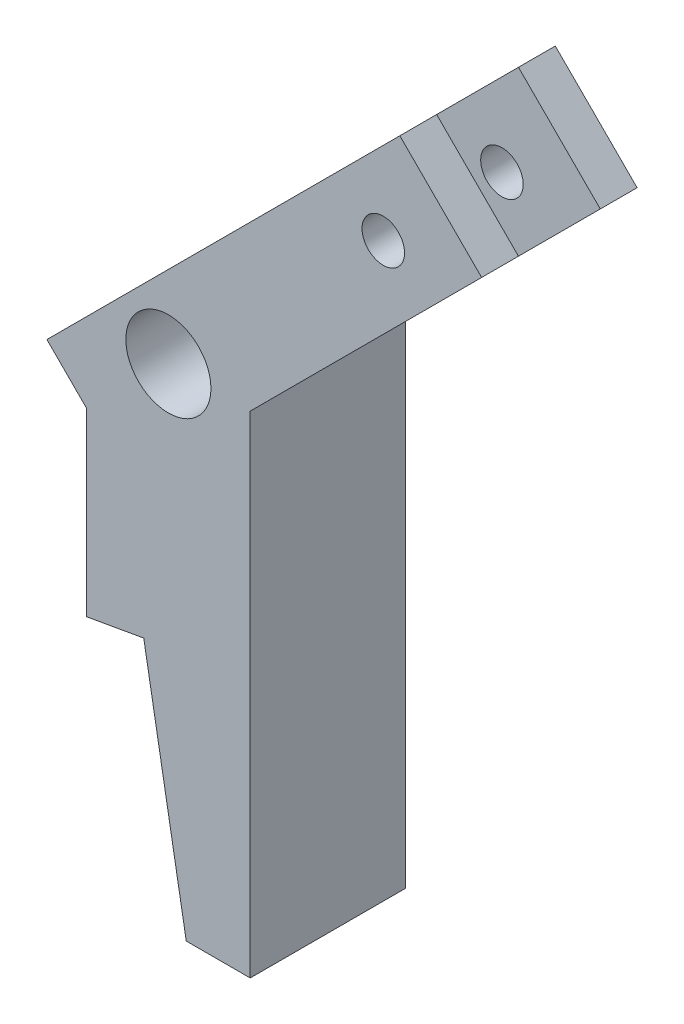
ISO-10303-21;
HEADER;
FILE_DESCRIPTION(('STEP AP214'),'2;1');
FILE_NAME('part.step','',(''),(''),'','','');
FILE_SCHEMA(('AUTOMOTIVE_DESIGN { 1 0 10303 214 1 1 1 1 }'));
ENDSEC;
DATA;
#1=APPLICATION_CONTEXT('core data for automotive mechanical design processes');
#2=APPLICATION_PROTOCOL_DEFINITION('international standard','automotive_design',2000,#1);
#3=PRODUCT_CONTEXT('',#1,'mechanical');
#4=PRODUCT('Part','Part','',(#3));
#5=PRODUCT_RELATED_PRODUCT_CATEGORY('part','',(#4));
#6=PRODUCT_DEFINITION_FORMATION('','',#4);
#7=PRODUCT_DEFINITION_CONTEXT('part definition',#1,'design');
#8=PRODUCT_DEFINITION('design','',#6,#7);
#9=PRODUCT_DEFINITION_SHAPE('','',#8);
#10=(LENGTH_UNIT() NAMED_UNIT(*) SI_UNIT(.MILLI.,.METRE.));
#11=(NAMED_UNIT(*) PLANE_ANGLE_UNIT() SI_UNIT($,.RADIAN.));
#12=(NAMED_UNIT(*) SI_UNIT($,.STERADIAN.) SOLID_ANGLE_UNIT());
#13=UNCERTAINTY_MEASURE_WITH_UNIT(LENGTH_MEASURE(1.E-05),#10,'distance_accuracy_value','');
#14=(GEOMETRIC_REPRESENTATION_CONTEXT(3) GLOBAL_UNCERTAINTY_ASSIGNED_CONTEXT((#13)) GLOBAL_UNIT_ASSIGNED_CONTEXT((#10,
#11,#12)) REPRESENTATION_CONTEXT('',''));
#15=CARTESIAN_POINT('',(0.,0.,0.));
#16=DIRECTION('',(0.,0.,1.));
#17=DIRECTION('',(1.,0.,0.));
#18=AXIS2_PLACEMENT_3D('',#15,#16,#17);
#19=CARTESIAN_POINT('',(-5.,-15.,9.5));
#20=DIRECTION('',(0.,1.,0.));
#21=DIRECTION('',(0.,0.,1.));
#22=AXIS2_PLACEMENT_3D('',#19,#20,#21);
#23=PLANE('',#22);
#24=DIRECTION('',(0.,0.,1.));
#25=VECTOR('',#24,1.);
#26=CARTESIAN_POINT('',(1.09255967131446,-15.,9.5));
#27=LINE('',#26,#25);
#28=CARTESIAN_POINT('',(1.09255967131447,-15.,0.));
#29=VERTEX_POINT('',#28);
#30=CARTESIAN_POINT('',(1.09255967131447,-15.,9.5));
#31=VERTEX_POINT('',#30);
#32=EDGE_CURVE('E160',#29,#31,#27,.T.);
#33=ORIENTED_EDGE('',*,*,#32,.F.);
#34=DIRECTION('',(1.,0.,0.));
#35=VECTOR('',#34,1.);
#36=CARTESIAN_POINT('',(-5.,-15.,0.));
#37=LINE('',#36,#35);
#38=CARTESIAN_POINT('',(5.,-15.,0.));
#39=VERTEX_POINT('',#38);
#40=EDGE_CURVE('E254',#29,#39,#37,.T.);
#41=ORIENTED_EDGE('',*,*,#40,.T.);
#42=DIRECTION('',(0.,0.,-1.));
#43=VECTOR('',#42,1.);
#44=CARTESIAN_POINT('',(5.,-15.,9.5));
#45=LINE('',#44,#43);
#46=CARTESIAN_POINT('',(5.,-15.,9.5));
#47=VERTEX_POINT('',#46);
#48=EDGE_CURVE('E258',#47,#39,#45,.T.);
#49=ORIENTED_EDGE('',*,*,#48,.F.);
#50=DIRECTION('',(1.,0.,0.));
#51=VECTOR('',#50,1.);
#52=CARTESIAN_POINT('',(-5.,-15.,9.5));
#53=LINE('',#52,#51);
#54=EDGE_CURVE('E256',#31,#47,#53,.T.);
#55=ORIENTED_EDGE('',*,*,#54,.F.);
#56=EDGE_LOOP('',(#33,#41,#49,#55));
#57=FACE_BOUND('',#56,.T.);
#58=ADVANCED_FACE('F53',(#57),#23,.F.);
#59=CARTESIAN_POINT('',(24.142135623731,24.1421356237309,0.));
#60=DIRECTION('',(-0.707106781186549,-0.707106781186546,0.));
#61=DIRECTION('',(0.707106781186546,-0.707106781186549,0.));
#62=AXIS2_PLACEMENT_3D('',#59,#60,#61);
#63=PLANE('',#62);
#64=DIRECTION('',(0.,0.,1.));
#65=VECTOR('',#64,1.);
#66=CARTESIAN_POINT('',(14.142135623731,34.1421356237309,9.5));
#67=LINE('',#66,#65);
#68=CARTESIAN_POINT('',(14.142135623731,34.1421356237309,0.));
#69=VERTEX_POINT('',#68);
#70=CARTESIAN_POINT('',(14.142135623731,34.1421356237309,2.25));
#71=VERTEX_POINT('',#70);
#72=EDGE_CURVE('E226',#69,#71,#67,.T.);
#73=ORIENTED_EDGE('',*,*,#72,.T.);
#74=DIRECTION('',(0.707106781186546,-0.707106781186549,0.));
#75=VECTOR('',#74,1.);
#76=CARTESIAN_POINT('',(24.142135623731,24.1421356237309,2.25));
#77=LINE('',#76,#75);
#78=CARTESIAN_POINT('',(19.142135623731,29.1421356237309,2.25));
#79=VERTEX_POINT('',#78);
#80=EDGE_CURVE('E274',#71,#79,#77,.T.);
#81=ORIENTED_EDGE('',*,*,#80,.T.);
#82=DIRECTION('',(0.,0.,-1.));
#83=VECTOR('',#82,1.);
#84=CARTESIAN_POINT('',(19.142135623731,29.1421356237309,9.5));
#85=LINE('',#84,#83);
#86=CARTESIAN_POINT('',(19.142135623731,29.1421356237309,0.));
#87=VERTEX_POINT('',#86);
#88=EDGE_CURVE('E216',#79,#87,#85,.T.);
#89=ORIENTED_EDGE('',*,*,#88,.T.);
#90=DIRECTION('',(-0.707106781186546,0.707106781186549,0.));
#91=VECTOR('',#90,1.);
#92=CARTESIAN_POINT('',(19.142135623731,29.1421356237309,0.));
#93=LINE('',#92,#91);
#94=EDGE_CURVE('E222',#87,#69,#93,.T.);
#95=ORIENTED_EDGE('',*,*,#94,.T.);
#96=EDGE_LOOP('',(#73,#81,#89,#95));
#97=FACE_BOUND('',#96,.T.);
#98=ADVANCED_FACE('F305',(#97),#63,.F.);
#99=CARTESIAN_POINT('',(4.99999999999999,15.,9.5));
#100=DIRECTION('',(-1.,0.,0.));
#101=DIRECTION('',(0.,-1.,0.));
#102=AXIS2_PLACEMENT_3D('',#99,#100,#101);
#103=PLANE('',#102);
#104=DIRECTION('',(0.,1.,0.));
#105=VECTOR('',#104,1.);
#106=CARTESIAN_POINT('',(4.99999999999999,15.,0.));
#107=LINE('',#106,#105);
#108=CARTESIAN_POINT('',(4.99999999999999,15.,0.));
#109=VERTEX_POINT('',#108);
#110=EDGE_CURVE('E250',#39,#109,#107,.T.);
#111=ORIENTED_EDGE('',*,*,#110,.T.);
#112=DIRECTION('',(0.,0.,-1.));
#113=VECTOR('',#112,1.);
#114=CARTESIAN_POINT('',(4.99999999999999,15.,9.5));
#115=LINE('',#114,#113);
#116=CARTESIAN_POINT('',(4.99999999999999,15.,9.5));
#117=VERTEX_POINT('',#116);
#118=EDGE_CURVE('E267',#117,#109,#115,.T.);
#119=ORIENTED_EDGE('',*,*,#118,.F.);
#120=DIRECTION('',(0.,1.,0.));
#121=VECTOR('',#120,1.);
#122=CARTESIAN_POINT('',(4.99999999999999,15.,9.5));
#123=LINE('',#122,#121);
#124=EDGE_CURVE('E251',#47,#117,#123,.T.);
#125=ORIENTED_EDGE('',*,*,#124,.F.);
#126=ORIENTED_EDGE('',*,*,#48,.T.);
#127=EDGE_LOOP('',(#111,#119,#125,#126));
#128=FACE_BOUND('',#127,.T.);
#129=ADVANCED_FACE('F324',(#128),#103,.F.);
#130=CARTESIAN_POINT('',(-5.00000000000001,15.,9.5));
#131=DIRECTION('',(1.,0.,0.));
#132=DIRECTION('',(0.,1.,0.));
#133=AXIS2_PLACEMENT_3D('',#130,#131,#132);
#134=PLANE('',#133);
#135=DIRECTION('',(0.,-1.,0.));
#136=VECTOR('',#135,1.);
#137=CARTESIAN_POINT('',(-5.00000000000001,15.,0.));
#138=LINE('',#137,#136);
#139=CARTESIAN_POINT('',(-5.,10.1507575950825,0.));
#140=VERTEX_POINT('',#139);
#141=CARTESIAN_POINT('',(-5.,-0.881634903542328,0.));
#142=VERTEX_POINT('',#141);
#143=EDGE_CURVE('E261',#140,#142,#138,.T.);
#144=ORIENTED_EDGE('',*,*,#143,.T.);
#145=DIRECTION('',(0.,0.,1.));
#146=VECTOR('',#145,1.);
#147=CARTESIAN_POINT('',(-5.,-0.881634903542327,9.5));
#148=LINE('',#147,#146);
#149=CARTESIAN_POINT('',(-5.,-0.881634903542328,9.5));
#150=VERTEX_POINT('',#149);
#151=EDGE_CURVE('E185',#142,#150,#148,.T.);
#152=ORIENTED_EDGE('',*,*,#151,.T.);
#153=DIRECTION('',(0.,-1.,0.));
#154=VECTOR('',#153,1.);
#155=CARTESIAN_POINT('',(-5.00000000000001,15.,9.5));
#156=LINE('',#155,#154);
#157=CARTESIAN_POINT('',(-5.00000000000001,10.1507575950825,9.5));
#158=VERTEX_POINT('',#157);
#159=EDGE_CURVE('E179',#158,#150,#156,.T.);
#160=ORIENTED_EDGE('',*,*,#159,.F.);
#161=DIRECTION('',(0.,0.,-1.));
#162=VECTOR('',#161,1.);
#163=CARTESIAN_POINT('',(-5.00000000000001,10.1507575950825,9.5));
#164=LINE('',#163,#162);
#165=EDGE_CURVE('E241',#158,#140,#164,.T.);
#166=ORIENTED_EDGE('',*,*,#165,.T.);
#167=EDGE_LOOP('',(#144,#152,#160,#166));
#168=FACE_BOUND('',#167,.T.);
#169=ADVANCED_FACE('F315',(#168),#134,.F.);
#170=CARTESIAN_POINT('',(0.,0.,9.5));
#171=DIRECTION('',(0.,0.,1.));
#172=DIRECTION('',(1.,0.,0.));
#173=AXIS2_PLACEMENT_3D('',#170,#171,#172);
#174=PLANE('',#173);
#175=DIRECTION('',(-0.984807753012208,-0.173648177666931,0.));
#176=VECTOR('',#175,1.);
#177=CARTESIAN_POINT('',(-1.50553610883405,-0.265466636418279,9.5));
#178=LINE('',#177,#176);
#179=CARTESIAN_POINT('',(-1.50553610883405,-0.265466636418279,9.5));
#180=VERTEX_POINT('',#179);
#181=EDGE_CURVE('E167',#180,#150,#178,.T.);
#182=ORIENTED_EDGE('',*,*,#181,.F.);
#183=DIRECTION('',(-0.173648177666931,0.984807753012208,0.));
#184=VECTOR('',#183,1.);
#185=CARTESIAN_POINT('',(1.09918655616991,-15.0375829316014,9.5));
#186=LINE('',#185,#184);
#187=EDGE_CURVE('E154',#31,#180,#186,.T.);
#188=ORIENTED_EDGE('',*,*,#187,.F.);
#189=ORIENTED_EDGE('',*,*,#54,.T.);
#190=ORIENTED_EDGE('',*,*,#124,.T.);
#191=DIRECTION('',(0.707106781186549,0.707106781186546,0.));
#192=VECTOR('',#191,1.);
#193=CARTESIAN_POINT('',(-2.42462120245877,7.57537879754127,9.5));
#194=LINE('',#193,#192);
#195=CARTESIAN_POINT('',(19.142135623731,29.1421356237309,9.5));
#196=VERTEX_POINT('',#195);
#197=EDGE_CURVE('E237',#117,#196,#194,.T.);
#198=ORIENTED_EDGE('',*,*,#197,.T.);
#199=DIRECTION('',(0.707106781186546,-0.707106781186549,0.));
#200=VECTOR('',#199,1.);
#201=CARTESIAN_POINT('',(19.142135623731,29.1421356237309,9.5));
#202=LINE('',#201,#200);
#203=CARTESIAN_POINT('',(14.142135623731,34.1421356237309,9.5));
#204=VERTEX_POINT('',#203);
#205=EDGE_CURVE('E214',#204,#196,#202,.T.);
#206=ORIENTED_EDGE('',*,*,#205,.F.);
#207=DIRECTION('',(0.707106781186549,0.707106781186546,0.));
#208=VECTOR('',#207,1.);
#209=CARTESIAN_POINT('',(-7.42462120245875,12.5753787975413,9.5));
#210=LINE('',#209,#208);
#211=CARTESIAN_POINT('',(-7.42462120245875,12.5753787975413,9.5));
#212=VERTEX_POINT('',#211);
#213=EDGE_CURVE('E238',#212,#204,#210,.T.);
#214=ORIENTED_EDGE('',*,*,#213,.F.);
#215=DIRECTION('',(0.707106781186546,-0.707106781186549,0.));
#216=VECTOR('',#215,1.);
#217=CARTESIAN_POINT('',(-2.42462120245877,7.57537879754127,9.5));
#218=LINE('',#217,#216);
#219=EDGE_CURVE('E229',#212,#158,#218,.T.);
#220=ORIENTED_EDGE('',*,*,#219,.T.);
#221=ORIENTED_EDGE('',*,*,#159,.T.);
#222=EDGE_LOOP('',(#182,#188,#189,#190,#198,#206,#214,#220,#221));
#223=FACE_BOUND('',#222,.T.);
#224=CARTESIAN_POINT('',(13.1317279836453,28.0814754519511,9.5));
#225=DIRECTION('',(0.,0.,1.));
#226=DIRECTION('',(1.,0.,0.));
#227=AXIS2_PLACEMENT_3D('',#224,#225,#226);
#228=CIRCLE('',#227,1.3);
#229=CARTESIAN_POINT('',(14.4317279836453,28.0814754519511,9.5));
#230=VERTEX_POINT('',#229);
#231=EDGE_CURVE('E194',#230,#230,#228,.T.);
#232=ORIENTED_EDGE('',*,*,#231,.F.);
#233=EDGE_LOOP('',(#232));
#234=FACE_BOUND('',#233,.T.);
#235=CARTESIAN_POINT('',(0.,15.,9.5));
#236=DIRECTION('',(0.,0.,1.));
#237=DIRECTION('',(1.,0.,0.));
#238=AXIS2_PLACEMENT_3D('',#235,#236,#237);
#239=CIRCLE('',#238,2.6);
#240=CARTESIAN_POINT('',(2.6,15.,9.5));
#241=VERTEX_POINT('',#240);
#242=EDGE_CURVE('E210',#241,#241,#239,.T.);
#243=ORIENTED_EDGE('',*,*,#242,.F.);
#244=EDGE_LOOP('',(#243));
#245=FACE_BOUND('',#244,.T.);
#246=ADVANCED_FACE('F175',(#223,#234,#245),#174,.T.);
#247=CARTESIAN_POINT('',(0.,0.,0.));
#248=DIRECTION('',(0.,0.,1.));
#249=DIRECTION('',(1.,0.,0.));
#250=AXIS2_PLACEMENT_3D('',#247,#248,#249);
#251=PLANE('',#250);
#252=CARTESIAN_POINT('',(13.1317279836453,28.0814754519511,0.));
#253=DIRECTION('',(0.,0.,-1.));
#254=DIRECTION('',(-1.,0.,0.));
#255=AXIS2_PLACEMENT_3D('',#252,#253,#254);
#256=CIRCLE('',#255,1.3);
#257=CARTESIAN_POINT('',(11.8317279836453,28.0814754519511,0.));
#258=VERTEX_POINT('',#257);
#259=EDGE_CURVE('E187',#258,#258,#256,.T.);
#260=ORIENTED_EDGE('',*,*,#259,.F.);
#261=EDGE_LOOP('',(#260));
#262=FACE_BOUND('',#261,.T.);
#263=CARTESIAN_POINT('',(0.,15.,0.));
#264=DIRECTION('',(0.,0.,1.));
#265=DIRECTION('',(1.,0.,0.));
#266=AXIS2_PLACEMENT_3D('',#263,#264,#265);
#267=CIRCLE('',#266,2.6);
#268=CARTESIAN_POINT('',(2.6,15.,0.));
#269=VERTEX_POINT('',#268);
#270=EDGE_CURVE('E213',#269,#269,#267,.T.);
#271=ORIENTED_EDGE('',*,*,#270,.T.);
#272=EDGE_LOOP('',(#271));
#273=FACE_BOUND('',#272,.T.);
#274=DIRECTION('',(0.173648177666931,-0.984807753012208,0.));
#275=VECTOR('',#274,1.);
#276=CARTESIAN_POINT('',(1.09918655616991,-15.0375829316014,0.));
#277=LINE('',#276,#275);
#278=CARTESIAN_POINT('',(-1.50553610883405,-0.265466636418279,0.));
#279=VERTEX_POINT('',#278);
#280=EDGE_CURVE('E172',#279,#29,#277,.T.);
#281=ORIENTED_EDGE('',*,*,#280,.F.);
#282=DIRECTION('',(-0.984807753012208,-0.173648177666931,0.));
#283=VECTOR('',#282,1.);
#284=CARTESIAN_POINT('',(-1.50553610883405,-0.265466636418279,0.));
#285=LINE('',#284,#283);
#286=EDGE_CURVE('E170',#279,#142,#285,.T.);
#287=ORIENTED_EDGE('',*,*,#286,.T.);
#288=ORIENTED_EDGE('',*,*,#143,.F.);
#289=DIRECTION('',(-0.707106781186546,0.707106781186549,0.));
#290=VECTOR('',#289,1.);
#291=CARTESIAN_POINT('',(-2.42462120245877,7.57537879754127,0.));
#292=LINE('',#291,#290);
#293=CARTESIAN_POINT('',(-7.42462120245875,12.5753787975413,0.));
#294=VERTEX_POINT('',#293);
#295=EDGE_CURVE('E231',#140,#294,#292,.T.);
#296=ORIENTED_EDGE('',*,*,#295,.T.);
#297=DIRECTION('',(0.707106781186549,0.707106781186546,0.));
#298=VECTOR('',#297,1.);
#299=CARTESIAN_POINT('',(-7.42462120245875,12.5753787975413,0.));
#300=LINE('',#299,#298);
#301=EDGE_CURVE('E242',#294,#69,#300,.T.);
#302=ORIENTED_EDGE('',*,*,#301,.T.);
#303=ORIENTED_EDGE('',*,*,#94,.F.);
#304=DIRECTION('',(0.707106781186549,0.707106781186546,0.));
#305=VECTOR('',#304,1.);
#306=CARTESIAN_POINT('',(-2.42462120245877,7.57537879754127,0.));
#307=LINE('',#306,#305);
#308=EDGE_CURVE('E244',#109,#87,#307,.T.);
#309=ORIENTED_EDGE('',*,*,#308,.F.);
#310=ORIENTED_EDGE('',*,*,#110,.F.);
#311=ORIENTED_EDGE('',*,*,#40,.F.);
#312=EDGE_LOOP('',(#281,#287,#288,#296,#302,#303,#309,#310,#311));
#313=FACE_BOUND('',#312,.T.);
#314=ADVANCED_FACE('F309',(#262,#273,#313),#251,.F.);
#315=CARTESIAN_POINT('',(-7.42462120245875,12.5753787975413,9.5));
#316=DIRECTION('',(-0.707106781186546,0.707106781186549,0.));
#317=DIRECTION('',(-0.707106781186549,-0.707106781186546,0.));
#318=AXIS2_PLACEMENT_3D('',#315,#316,#317);
#319=PLANE('',#318);
#320=DIRECTION('',(0.,0.,-1.));
#321=VECTOR('',#320,1.);
#322=CARTESIAN_POINT('',(2.52188165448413,22.5218816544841,9.5));
#323=LINE('',#322,#321);
#324=CARTESIAN_POINT('',(2.52188165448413,22.5218816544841,7.25));
#325=VERTEX_POINT('',#324);
#326=CARTESIAN_POINT('',(2.52188165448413,22.5218816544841,2.25));
#327=VERTEX_POINT('',#326);
#328=EDGE_CURVE('E280',#325,#327,#323,.T.);
#329=ORIENTED_EDGE('',*,*,#328,.T.);
#330=DIRECTION('',(-0.707106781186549,-0.707106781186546,0.));
#331=VECTOR('',#330,1.);
#332=CARTESIAN_POINT('',(-7.42462120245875,12.5753787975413,2.25));
#333=LINE('',#332,#331);
#334=EDGE_CURVE('E208',#71,#327,#333,.T.);
#335=ORIENTED_EDGE('',*,*,#334,.F.);
#336=ORIENTED_EDGE('',*,*,#72,.F.);
#337=ORIENTED_EDGE('',*,*,#301,.F.);
#338=DIRECTION('',(0.,0.,1.));
#339=VECTOR('',#338,1.);
#340=CARTESIAN_POINT('',(-7.42462120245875,12.5753787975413,9.5));
#341=LINE('',#340,#339);
#342=EDGE_CURVE('E234',#294,#212,#341,.T.);
#343=ORIENTED_EDGE('',*,*,#342,.T.);
#344=ORIENTED_EDGE('',*,*,#213,.T.);
#345=CARTESIAN_POINT('',(14.142135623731,34.1421356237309,7.25));
#346=VERTEX_POINT('',#345);
#347=EDGE_CURVE('E225',#346,#204,#67,.T.);
#348=ORIENTED_EDGE('',*,*,#347,.F.);
#349=DIRECTION('',(0.707106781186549,0.707106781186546,0.));
#350=VECTOR('',#349,1.);
#351=CARTESIAN_POINT('',(-7.42462120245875,12.5753787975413,7.25));
#352=LINE('',#351,#350);
#353=EDGE_CURVE('E204',#325,#346,#352,.T.);
#354=ORIENTED_EDGE('',*,*,#353,.F.);
#355=EDGE_LOOP('',(#329,#335,#336,#337,#343,#344,#348,#354));
#356=FACE_BOUND('',#355,.T.);
#357=ADVANCED_FACE('F288',(#356),#319,.T.);
#358=CARTESIAN_POINT('',(-2.42462120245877,7.57537879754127,9.5));
#359=DIRECTION('',(0.707106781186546,-0.707106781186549,0.));
#360=DIRECTION('',(0.707106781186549,0.707106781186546,0.));
#361=AXIS2_PLACEMENT_3D('',#358,#359,#360);
#362=PLANE('',#361);
#363=DIRECTION('',(0.707106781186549,0.707106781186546,0.));
#364=VECTOR('',#363,1.);
#365=CARTESIAN_POINT('',(-2.42462120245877,7.57537879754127,2.25));
#366=LINE('',#365,#364);
#367=CARTESIAN_POINT('',(12.0710678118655,22.0710678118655,2.25));
#368=VERTEX_POINT('',#367);
#369=EDGE_CURVE('E206',#368,#79,#366,.T.);
#370=ORIENTED_EDGE('',*,*,#369,.F.);
#371=DIRECTION('',(0.,0.,1.));
#372=VECTOR('',#371,1.);
#373=CARTESIAN_POINT('',(12.0710678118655,22.0710678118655,9.5));
#374=LINE('',#373,#372);
#375=CARTESIAN_POINT('',(12.0710678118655,22.0710678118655,7.25));
#376=VERTEX_POINT('',#375);
#377=EDGE_CURVE('E277',#368,#376,#374,.T.);
#378=ORIENTED_EDGE('',*,*,#377,.T.);
#379=DIRECTION('',(-0.707106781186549,-0.707106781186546,0.));
#380=VECTOR('',#379,1.);
#381=CARTESIAN_POINT('',(-2.42462120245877,7.57537879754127,7.25));
#382=LINE('',#381,#380);
#383=CARTESIAN_POINT('',(19.142135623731,29.1421356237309,7.25));
#384=VERTEX_POINT('',#383);
#385=EDGE_CURVE('E201',#384,#376,#382,.T.);
#386=ORIENTED_EDGE('',*,*,#385,.F.);
#387=EDGE_CURVE('E217',#196,#384,#85,.T.);
#388=ORIENTED_EDGE('',*,*,#387,.F.);
#389=ORIENTED_EDGE('',*,*,#197,.F.);
#390=ORIENTED_EDGE('',*,*,#118,.T.);
#391=ORIENTED_EDGE('',*,*,#308,.T.);
#392=ORIENTED_EDGE('',*,*,#88,.F.);
#393=EDGE_LOOP('',(#370,#378,#386,#388,#389,#390,#391,#392));
#394=FACE_BOUND('',#393,.T.);
#395=ADVANCED_FACE('F301',(#394),#362,.T.);
#396=CARTESIAN_POINT('',(2.57537879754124,2.57537879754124,0.));
#397=DIRECTION('',(-0.707106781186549,-0.707106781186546,0.));
#398=DIRECTION('',(0.707106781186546,-0.707106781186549,0.));
#399=AXIS2_PLACEMENT_3D('',#396,#397,#398);
#400=PLANE('',#399);
#401=ORIENTED_EDGE('',*,*,#165,.F.);
#402=ORIENTED_EDGE('',*,*,#219,.F.);
#403=ORIENTED_EDGE('',*,*,#342,.F.);
#404=ORIENTED_EDGE('',*,*,#295,.F.);
#405=EDGE_LOOP('',(#401,#402,#403,#404));
#406=FACE_BOUND('',#405,.T.);
#407=ADVANCED_FACE('F312',(#406),#400,.T.);
#408=ORIENTED_EDGE('',*,*,#387,.T.);
#409=DIRECTION('',(-0.707106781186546,0.707106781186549,0.));
#410=VECTOR('',#409,1.);
#411=CARTESIAN_POINT('',(24.142135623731,24.1421356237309,7.25));
#412=LINE('',#411,#410);
#413=EDGE_CURVE('E269',#384,#346,#412,.T.);
#414=ORIENTED_EDGE('',*,*,#413,.T.);
#415=ORIENTED_EDGE('',*,*,#347,.T.);
#416=ORIENTED_EDGE('',*,*,#205,.T.);
#417=EDGE_LOOP('',(#408,#414,#415,#416));
#418=FACE_BOUND('',#417,.T.);
#419=ADVANCED_FACE('F326',(#418),#63,.F.);
#420=CARTESIAN_POINT('',(0.,15.,-0.5));
#421=DIRECTION('',(0.,0.,1.));
#422=DIRECTION('',(1.,0.,0.));
#423=AXIS2_PLACEMENT_3D('',#420,#421,#422);
#424=CYLINDRICAL_SURFACE('',#423,2.6);
#425=ORIENTED_EDGE('',*,*,#242,.T.);
#426=EDGE_LOOP('',(#425));
#427=FACE_BOUND('',#426,.T.);
#428=ORIENTED_EDGE('',*,*,#270,.F.);
#429=EDGE_LOOP('',(#428));
#430=FACE_BOUND('',#429,.T.);
#431=ADVANCED_FACE('F328',(#427,#430),#424,.F.);
#432=CARTESIAN_POINT('',(3.1517039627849,30.9904316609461,2.25));
#433=DIRECTION('',(0.,0.,-1.));
#434=DIRECTION('',(0.,1.,0.));
#435=AXIS2_PLACEMENT_3D('',#432,#433,#434);
#436=PLANE('',#435);
#437=CARTESIAN_POINT('',(13.1317279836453,28.0814754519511,2.25));
#438=DIRECTION('',(0.,0.,-1.));
#439=DIRECTION('',(0.,1.,0.));
#440=AXIS2_PLACEMENT_3D('',#437,#438,#439);
#441=CIRCLE('',#440,1.3);
#442=CARTESIAN_POINT('',(13.1317279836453,29.3814754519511,2.25));
#443=VERTEX_POINT('',#442);
#444=EDGE_CURVE('E191',#443,#443,#441,.T.);
#445=ORIENTED_EDGE('',*,*,#444,.T.);
#446=EDGE_LOOP('',(#445));
#447=FACE_BOUND('',#446,.T.);
#448=ORIENTED_EDGE('',*,*,#334,.T.);
#449=DIRECTION('',(-0.93969262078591,-0.342020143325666,0.));
#450=VECTOR('',#449,1.);
#451=CARTESIAN_POINT('',(5.79976825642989,23.7149348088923,2.25));
#452=LINE('',#451,#450);
#453=CARTESIAN_POINT('',(9.19238815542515,24.9497474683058,2.25));
#454=VERTEX_POINT('',#453);
#455=EDGE_CURVE('E62',#327,#454,#452,.F.);
#456=ORIENTED_EDGE('',*,*,#455,.T.);
#457=DIRECTION('',(-0.707106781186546,0.707106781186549,0.));
#458=VECTOR('',#457,1.);
#459=CARTESIAN_POINT('',(3.1517039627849,30.9904316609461,2.25));
#460=LINE('',#459,#458);
#461=EDGE_CURVE('E197',#368,#454,#460,.T.);
#462=ORIENTED_EDGE('',*,*,#461,.F.);
#463=ORIENTED_EDGE('',*,*,#369,.T.);
#464=ORIENTED_EDGE('',*,*,#80,.F.);
#465=EDGE_LOOP('',(#448,#456,#462,#463,#464));
#466=FACE_BOUND('',#465,.T.);
#467=ADVANCED_FACE('F299',(#447,#466),#436,.F.);
#468=CARTESIAN_POINT('',(3.1517039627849,30.9904316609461,7.25));
#469=DIRECTION('',(0.,0.,1.));
#470=DIRECTION('',(0.,-1.,0.));
#471=AXIS2_PLACEMENT_3D('',#468,#469,#470);
#472=PLANE('',#471);
#473=CARTESIAN_POINT('',(13.1317279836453,28.0814754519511,7.25));
#474=DIRECTION('',(0.,0.,1.));
#475=DIRECTION('',(0.,-1.,0.));
#476=AXIS2_PLACEMENT_3D('',#473,#474,#475);
#477=CIRCLE('',#476,1.3);
#478=CARTESIAN_POINT('',(13.1317279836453,26.7814754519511,7.25));
#479=VERTEX_POINT('',#478);
#480=EDGE_CURVE('E190',#479,#479,#477,.T.);
#481=ORIENTED_EDGE('',*,*,#480,.T.);
#482=EDGE_LOOP('',(#481));
#483=FACE_BOUND('',#482,.T.);
#484=ORIENTED_EDGE('',*,*,#353,.T.);
#485=ORIENTED_EDGE('',*,*,#413,.F.);
#486=ORIENTED_EDGE('',*,*,#385,.T.);
#487=DIRECTION('',(0.707106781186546,-0.707106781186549,0.));
#488=VECTOR('',#487,1.);
#489=CARTESIAN_POINT('',(3.1517039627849,30.9904316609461,7.25));
#490=LINE('',#489,#488);
#491=CARTESIAN_POINT('',(9.19238815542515,24.9497474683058,7.25));
#492=VERTEX_POINT('',#491);
#493=EDGE_CURVE('E199',#492,#376,#490,.T.);
#494=ORIENTED_EDGE('',*,*,#493,.F.);
#495=DIRECTION('',(0.93969262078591,0.342020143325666,0.));
#496=VECTOR('',#495,1.);
#497=CARTESIAN_POINT('',(5.79976825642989,23.7149348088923,7.25));
#498=LINE('',#497,#496);
#499=EDGE_CURVE('E12',#492,#325,#498,.F.);
#500=ORIENTED_EDGE('',*,*,#499,.T.);
#501=EDGE_LOOP('',(#484,#485,#486,#494,#500));
#502=FACE_BOUND('',#501,.T.);
#503=ADVANCED_FACE('F294',(#483,#502),#472,.F.);
#504=CARTESIAN_POINT('',(17.0710678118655,17.0710678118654,0.));
#505=DIRECTION('',(0.707106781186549,0.707106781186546,0.));
#506=DIRECTION('',(-0.707106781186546,0.707106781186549,0.));
#507=AXIS2_PLACEMENT_3D('',#504,#505,#506);
#508=PLANE('',#507);
#509=ORIENTED_EDGE('',*,*,#461,.T.);
#510=DIRECTION('',(0.,0.,1.));
#511=VECTOR('',#510,1.);
#512=CARTESIAN_POINT('',(9.19238815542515,24.9497474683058,0.));
#513=LINE('',#512,#511);
#514=EDGE_CURVE('E75',#454,#492,#513,.T.);
#515=ORIENTED_EDGE('',*,*,#514,.T.);
#516=ORIENTED_EDGE('',*,*,#493,.T.);
#517=ORIENTED_EDGE('',*,*,#377,.F.);
#518=EDGE_LOOP('',(#509,#515,#516,#517));
#519=FACE_BOUND('',#518,.T.);
#520=ADVANCED_FACE('F296',(#519),#508,.T.);
#521=CARTESIAN_POINT('',(13.1317279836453,28.0814754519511,20.));
#522=DIRECTION('',(0.,0.,-1.));
#523=DIRECTION('',(-1.,0.,0.));
#524=AXIS2_PLACEMENT_3D('',#521,#522,#523);
#525=CYLINDRICAL_SURFACE('',#524,1.3);
#526=ORIENTED_EDGE('',*,*,#231,.T.);
#527=EDGE_LOOP('',(#526));
#528=FACE_BOUND('',#527,.T.);
#529=ORIENTED_EDGE('',*,*,#480,.F.);
#530=EDGE_LOOP('',(#529));
#531=FACE_BOUND('',#530,.T.);
#532=ADVANCED_FACE('F370',(#528,#531),#525,.F.);
#533=ORIENTED_EDGE('',*,*,#259,.T.);
#534=EDGE_LOOP('',(#533));
#535=FACE_BOUND('',#534,.T.);
#536=ORIENTED_EDGE('',*,*,#444,.F.);
#537=EDGE_LOOP('',(#536));
#538=FACE_BOUND('',#537,.T.);
#539=ADVANCED_FACE('F400',(#535,#538),#525,.F.);
#540=CARTESIAN_POINT('',(-1.50553610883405,-0.265466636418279,9.5));
#541=DIRECTION('',(-0.173648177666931,0.984807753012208,0.));
#542=DIRECTION('',(-0.984807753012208,-0.173648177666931,0.));
#543=AXIS2_PLACEMENT_3D('',#540,#541,#542);
#544=PLANE('',#543);
#545=ORIENTED_EDGE('',*,*,#286,.F.);
#546=DIRECTION('',(0.,0.,-1.));
#547=VECTOR('',#546,1.);
#548=CARTESIAN_POINT('',(-1.50553610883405,-0.265466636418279,9.5));
#549=LINE('',#548,#547);
#550=EDGE_CURVE('E157',#180,#279,#549,.T.);
#551=ORIENTED_EDGE('',*,*,#550,.F.);
#552=ORIENTED_EDGE('',*,*,#181,.T.);
#553=ORIENTED_EDGE('',*,*,#151,.F.);
#554=EDGE_LOOP('',(#545,#551,#552,#553));
#555=FACE_BOUND('',#554,.T.);
#556=ADVANCED_FACE('F166',(#555),#544,.F.);
#557=CARTESIAN_POINT('',(-1.50553610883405,-0.265466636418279,0.));
#558=DIRECTION('',(-0.984807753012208,-0.173648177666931,0.));
#559=DIRECTION('',(0.173648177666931,-0.984807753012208,0.));
#560=AXIS2_PLACEMENT_3D('',#557,#558,#559);
#561=PLANE('',#560);
#562=ORIENTED_EDGE('',*,*,#32,.T.);
#563=ORIENTED_EDGE('',*,*,#187,.T.);
#564=ORIENTED_EDGE('',*,*,#550,.T.);
#565=ORIENTED_EDGE('',*,*,#280,.T.);
#566=EDGE_LOOP('',(#562,#563,#564,#565));
#567=FACE_BOUND('',#566,.T.);
#568=ADVANCED_FACE('F156',(#567),#561,.T.);
#569=CARTESIAN_POINT('',(2.52188165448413,22.5218816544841,9.5));
#570=DIRECTION('',(0.342020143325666,-0.939692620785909,0.));
#571=DIRECTION('',(0.,0.,-1.));
#572=AXIS2_PLACEMENT_3D('',#569,#570,#571);
#573=PLANE('',#572);
#574=ORIENTED_EDGE('',*,*,#499,.F.);
#575=ORIENTED_EDGE('',*,*,#514,.F.);
#576=ORIENTED_EDGE('',*,*,#455,.F.);
#577=ORIENTED_EDGE('',*,*,#328,.F.);
#578=EDGE_LOOP('',(#574,#575,#576,#577));
#579=FACE_BOUND('',#578,.T.);
#580=ADVANCED_FACE('F56',(#579),#573,.F.);
#581=CLOSED_SHELL('',(#58,#98,#129,#169,#246,#314,#357,#395,#407,#419,#431,#467,#503,#520,#532,
#539,#556,#568,#580));
#582=MANIFOLD_SOLID_BREP('B2',#581);
#583=ADVANCED_BREP_SHAPE_REPRESENTATION('',(#18,#582),#14);
#584=SHAPE_DEFINITION_REPRESENTATION(#9,#583);
ENDSEC;
END-ISO-10303-21;
